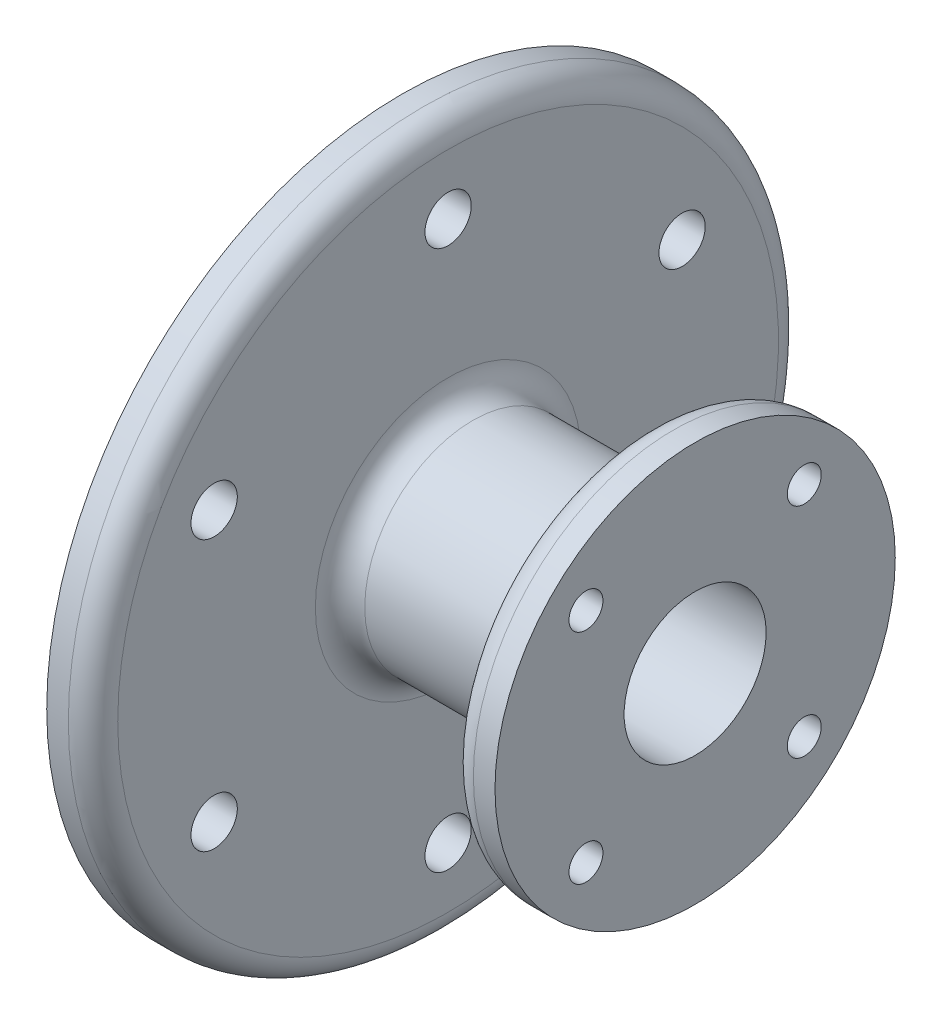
from build123d import *

# Parameters (mm, degrees)
CONG_1_R                     = 8
ENL_V_MAT_EXTRU_1_REACH      = 255.525
ESQUISSE4_R                  = 5.5
CHANFREIN1_SIZE              = 3
EXTRUSION1_REACH             = 255.525
ESQUISSE5_R                  = 7.5
R_P_TITION_CIRCULAIRE1_COUNT = 6


with BuildPart() as part:
    # Esquisse3 → R_volution1 (revolve)
    with BuildSketch(Plane.XY, mode=Mode.PRIVATE) as r_volution1_sk:
        Polygon((-153, -113), (-153, -154.824455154), (-168, -154.824455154), (-168, -125), (-233, -125), (-233, -205), (-248, -205), (-248, -121), (-263, -121), (-263, -113), align=None)
    revolve(r_volution1_sk.sketch.rotate(Axis((-121.019521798, -90, 0), (-1, 0, 0)), 270), axis=Axis((-121.019521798, -90, 0), (-1, 0, 0)))

    # Cong_1
    cong_1_edges = [part.edges().sort_by_distance(p)[0] for p in [
        (-168, -90, 64.824455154),
        (-168, -90, 35),
        (-233, -90, 35),
        (-233, -90, 115),
    ]]
    fillet(cong_1_edges, radius=CONG_1_R)

    # Esquisse4 → Enl_v. mat.-Extru.1 (cut, up to next)
    with BuildSketch(Plane.ZY.offset(168), mode=Mode.PRIVATE) as enl_v_mat_extru_1_sk1:
        with Locations((-35.355339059, -125.355339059)):
            Circle(ESQUISSE4_R)
    enl_v_mat_extru_1_tool1 = extrude(enl_v_mat_extru_1_sk1.sketch, amount=-ENL_V_MAT_EXTRU_1_REACH, mode=Mode.PRIVATE) & part.part
    # Esquisse4 → Enl_v. mat.-Extru.1 (cut, up to next)
    with BuildSketch(Plane.ZY.offset(168), mode=Mode.PRIVATE) as enl_v_mat_extru_1_sk2:
        with Locations((35.355339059, -125.355339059)):
            Circle(ESQUISSE4_R)
    enl_v_mat_extru_1_tool2 = extrude(enl_v_mat_extru_1_sk2.sketch, amount=-ENL_V_MAT_EXTRU_1_REACH, mode=Mode.PRIVATE) & part.part
    # Esquisse4 → Enl_v. mat.-Extru.1 (cut, up to next)
    with BuildSketch(Plane.ZY.offset(168), mode=Mode.PRIVATE) as enl_v_mat_extru_1_sk3:
        with Locations((35.355339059, -54.644660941)):
            Circle(ESQUISSE4_R)
    enl_v_mat_extru_1_tool3 = extrude(enl_v_mat_extru_1_sk3.sketch, amount=-ENL_V_MAT_EXTRU_1_REACH, mode=Mode.PRIVATE) & part.part
    # Esquisse4 → Enl_v. mat.-Extru.1 (cut, up to next)
    with BuildSketch(Plane.ZY.offset(168), mode=Mode.PRIVATE) as enl_v_mat_extru_1_sk4:
        with Locations((-35.355339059, -54.644660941)):
            Circle(ESQUISSE4_R)
    enl_v_mat_extru_1_tool4 = extrude(enl_v_mat_extru_1_sk4.sketch, amount=-ENL_V_MAT_EXTRU_1_REACH, mode=Mode.PRIVATE) & part.part
    add(enl_v_mat_extru_1_tool1.solids().sort_by_distance((-168, -125.355339, -35.355339))[0], mode=Mode.SUBTRACT)
    add(enl_v_mat_extru_1_tool2.solids().sort_by_distance((-168, -125.355339, 35.355339))[0], mode=Mode.SUBTRACT)
    add(enl_v_mat_extru_1_tool3.solids().sort_by_distance((-168, -54.644661, 35.355339))[0], mode=Mode.SUBTRACT)
    add(enl_v_mat_extru_1_tool4.solids().sort_by_distance((-168, -54.644661, -35.355339))[0], mode=Mode.SUBTRACT)

    # Chanfrein1
    chanfrein1_edges = [part.edges().sort_by_distance(p)[0] for p in [
        (-263, -90, 31),
    ]]
    chamfer(chanfrein1_edges, length=CHANFREIN1_SIZE)

    # Esquisse5 → Extrusion1 (cut, up to next)
    with BuildSketch(Plane.ZY.offset(248), mode=Mode.PRIVATE) as extrusion1_sk1:
        with Locations((0, -2.5)):
            Circle(ESQUISSE5_R)
    extrusion1_tool1 = extrude(extrusion1_sk1.sketch, amount=-EXTRUSION1_REACH, mode=Mode.PRIVATE) & part.part
    extrusion1 = extrusion1_tool1.solids().sort_by_distance((-248, -2.5, 0))[0]
    add(extrusion1, mode=Mode.SUBTRACT)

    # R_p_tition circulaire1: Extrusion1 ×6 about axis
    r_p_tition_circulaire1_axis = Axis((0, -90, 0), (1, 0, 0))
    for i in range(1, R_P_TITION_CIRCULAIRE1_COUNT):
        add(extrusion1.rotate(r_p_tition_circulaire1_axis, i * 360 / R_P_TITION_CIRCULAIRE1_COUNT), mode=Mode.SUBTRACT)


solid = part.part
